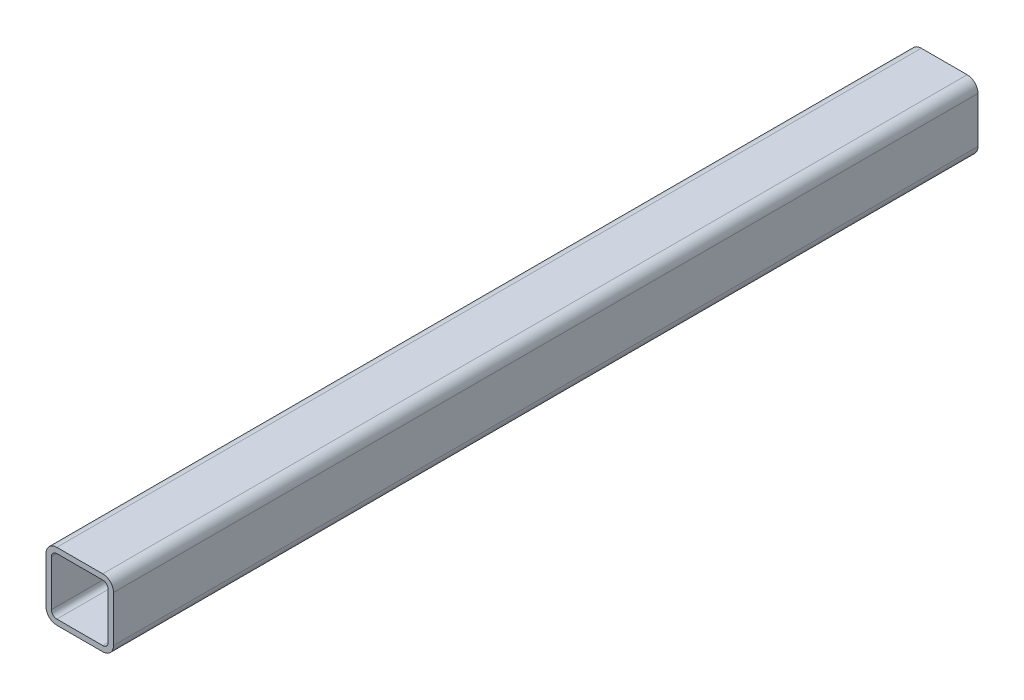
ISO-10303-21;
HEADER;
FILE_DESCRIPTION(('STEP AP214'),'2;1');
FILE_NAME('part.step','',(''),(''),'','','');
FILE_SCHEMA(('AUTOMOTIVE_DESIGN { 1 0 10303 214 1 1 1 1 }'));
ENDSEC;
DATA;
#1=APPLICATION_CONTEXT('core data for automotive mechanical design processes');
#2=APPLICATION_PROTOCOL_DEFINITION('international standard','automotive_design',2000,#1);
#3=PRODUCT_CONTEXT('',#1,'mechanical');
#4=PRODUCT('Part','Part','',(#3));
#5=PRODUCT_RELATED_PRODUCT_CATEGORY('part','',(#4));
#6=PRODUCT_DEFINITION_FORMATION('','',#4);
#7=PRODUCT_DEFINITION_CONTEXT('part definition',#1,'design');
#8=PRODUCT_DEFINITION('design','',#6,#7);
#9=PRODUCT_DEFINITION_SHAPE('','',#8);
#10=(LENGTH_UNIT() NAMED_UNIT(*) SI_UNIT(.MILLI.,.METRE.));
#11=(NAMED_UNIT(*) PLANE_ANGLE_UNIT() SI_UNIT($,.RADIAN.));
#12=(NAMED_UNIT(*) SI_UNIT($,.STERADIAN.) SOLID_ANGLE_UNIT());
#13=UNCERTAINTY_MEASURE_WITH_UNIT(LENGTH_MEASURE(1.E-05),#10,'distance_accuracy_value','');
#14=(GEOMETRIC_REPRESENTATION_CONTEXT(3) GLOBAL_UNCERTAINTY_ASSIGNED_CONTEXT((#13)) GLOBAL_UNIT_ASSIGNED_CONTEXT((#10,
#11,#12)) REPRESENTATION_CONTEXT('',''));
#15=CARTESIAN_POINT('',(0.,0.,0.));
#16=DIRECTION('',(0.,0.,1.));
#17=DIRECTION('',(1.,0.,0.));
#18=AXIS2_PLACEMENT_3D('',#15,#16,#17);
#19=CARTESIAN_POINT('',(12.5,12.5,160.));
#20=DIRECTION('',(0.,0.,1.));
#21=DIRECTION('',(1.,0.,0.));
#22=AXIS2_PLACEMENT_3D('',#19,#20,#21);
#23=PLANE('',#22);
#24=DIRECTION('',(1.,0.,0.));
#25=VECTOR('',#24,1.);
#26=CARTESIAN_POINT('',(-12.5,-12.5,160.));
#27=LINE('',#26,#25);
#28=CARTESIAN_POINT('',(-8.5,-12.5,160.));
#29=VERTEX_POINT('',#28);
#30=CARTESIAN_POINT('',(8.5,-12.5,160.));
#31=VERTEX_POINT('',#30);
#32=EDGE_CURVE('E197',#29,#31,#27,.T.);
#33=ORIENTED_EDGE('',*,*,#32,.T.);
#34=CARTESIAN_POINT('',(8.5,-8.5,160.));
#35=DIRECTION('',(0.,0.,1.));
#36=DIRECTION('',(1.,0.,0.));
#37=AXIS2_PLACEMENT_3D('',#34,#35,#36);
#38=CIRCLE('',#37,4.);
#39=CARTESIAN_POINT('',(12.5,-8.5,160.));
#40=VERTEX_POINT('',#39);
#41=EDGE_CURVE('E256',#31,#40,#38,.T.);
#42=ORIENTED_EDGE('',*,*,#41,.T.);
#43=DIRECTION('',(0.,1.,0.));
#44=VECTOR('',#43,1.);
#45=CARTESIAN_POINT('',(12.5,12.5,160.));
#46=LINE('',#45,#44);
#47=CARTESIAN_POINT('',(12.5,8.5,160.));
#48=VERTEX_POINT('',#47);
#49=EDGE_CURVE('E274',#40,#48,#46,.T.);
#50=ORIENTED_EDGE('',*,*,#49,.T.);
#51=CARTESIAN_POINT('',(8.5,8.5,160.));
#52=DIRECTION('',(0.,0.,1.));
#53=DIRECTION('',(1.,0.,0.));
#54=AXIS2_PLACEMENT_3D('',#51,#52,#53);
#55=CIRCLE('',#54,4.);
#56=CARTESIAN_POINT('',(8.5,12.5,160.));
#57=VERTEX_POINT('',#56);
#58=EDGE_CURVE('E252',#48,#57,#55,.T.);
#59=ORIENTED_EDGE('',*,*,#58,.T.);
#60=DIRECTION('',(-1.,0.,0.));
#61=VECTOR('',#60,1.);
#62=CARTESIAN_POINT('',(-12.5,12.5,160.));
#63=LINE('',#62,#61);
#64=CARTESIAN_POINT('',(-8.5,12.5,160.));
#65=VERTEX_POINT('',#64);
#66=EDGE_CURVE('E266',#57,#65,#63,.T.);
#67=ORIENTED_EDGE('',*,*,#66,.T.);
#68=CARTESIAN_POINT('',(-8.5,8.5,160.));
#69=DIRECTION('',(0.,0.,1.));
#70=DIRECTION('',(1.,0.,0.));
#71=AXIS2_PLACEMENT_3D('',#68,#69,#70);
#72=CIRCLE('',#71,4.);
#73=CARTESIAN_POINT('',(-12.5,8.5,160.));
#74=VERTEX_POINT('',#73);
#75=EDGE_CURVE('E79',#65,#74,#72,.T.);
#76=ORIENTED_EDGE('',*,*,#75,.T.);
#77=DIRECTION('',(0.,-1.,0.));
#78=VECTOR('',#77,1.);
#79=CARTESIAN_POINT('',(-12.5,12.5,160.));
#80=LINE('',#79,#78);
#81=CARTESIAN_POINT('',(-12.5,-8.5,160.));
#82=VERTEX_POINT('',#81);
#83=EDGE_CURVE('E202',#74,#82,#80,.T.);
#84=ORIENTED_EDGE('',*,*,#83,.T.);
#85=CARTESIAN_POINT('',(-8.5,-8.5,160.));
#86=DIRECTION('',(0.,0.,1.));
#87=DIRECTION('',(1.,0.,0.));
#88=AXIS2_PLACEMENT_3D('',#85,#86,#87);
#89=CIRCLE('',#88,4.);
#90=EDGE_CURVE('E254',#82,#29,#89,.T.);
#91=ORIENTED_EDGE('',*,*,#90,.T.);
#92=EDGE_LOOP('',(#33,#42,#50,#59,#67,#76,#84,#91));
#93=FACE_BOUND('',#92,.T.);
#94=DIRECTION('',(-1.,0.,0.));
#95=VECTOR('',#94,1.);
#96=CARTESIAN_POINT('',(-12.5,10.5,160.));
#97=LINE('',#96,#95);
#98=CARTESIAN_POINT('',(8.5,10.5,160.));
#99=VERTEX_POINT('',#98);
#100=CARTESIAN_POINT('',(-8.5,10.5,160.));
#101=VERTEX_POINT('',#100);
#102=EDGE_CURVE('E303',#99,#101,#97,.T.);
#103=ORIENTED_EDGE('',*,*,#102,.F.);
#104=CARTESIAN_POINT('',(8.5,8.5,160.));
#105=DIRECTION('',(0.,0.,1.));
#106=DIRECTION('',(1.,0.,0.));
#107=AXIS2_PLACEMENT_3D('',#104,#105,#106);
#108=CIRCLE('',#107,2.);
#109=CARTESIAN_POINT('',(10.5,8.5,160.));
#110=VERTEX_POINT('',#109);
#111=EDGE_CURVE('E183',#99,#110,#108,.F.);
#112=ORIENTED_EDGE('',*,*,#111,.T.);
#113=DIRECTION('',(0.,1.,0.));
#114=VECTOR('',#113,1.);
#115=CARTESIAN_POINT('',(10.5,12.5,160.));
#116=LINE('',#115,#114);
#117=CARTESIAN_POINT('',(10.5,-8.5,160.));
#118=VERTEX_POINT('',#117);
#119=EDGE_CURVE('E193',#118,#110,#116,.T.);
#120=ORIENTED_EDGE('',*,*,#119,.F.);
#121=CARTESIAN_POINT('',(8.5,-8.5,160.));
#122=DIRECTION('',(0.,0.,1.));
#123=DIRECTION('',(1.,0.,0.));
#124=AXIS2_PLACEMENT_3D('',#121,#122,#123);
#125=CIRCLE('',#124,2.);
#126=CARTESIAN_POINT('',(8.5,-10.5,160.));
#127=VERTEX_POINT('',#126);
#128=EDGE_CURVE('E223',#118,#127,#125,.F.);
#129=ORIENTED_EDGE('',*,*,#128,.T.);
#130=DIRECTION('',(1.,0.,0.));
#131=VECTOR('',#130,1.);
#132=CARTESIAN_POINT('',(-12.5,-10.5,160.));
#133=LINE('',#132,#131);
#134=CARTESIAN_POINT('',(-8.5,-10.5,160.));
#135=VERTEX_POINT('',#134);
#136=EDGE_CURVE('E288',#135,#127,#133,.T.);
#137=ORIENTED_EDGE('',*,*,#136,.F.);
#138=CARTESIAN_POINT('',(-8.5,-8.5,160.));
#139=DIRECTION('',(0.,0.,1.));
#140=DIRECTION('',(1.,0.,0.));
#141=AXIS2_PLACEMENT_3D('',#138,#139,#140);
#142=CIRCLE('',#141,2.);
#143=CARTESIAN_POINT('',(-10.5,-8.5,160.));
#144=VERTEX_POINT('',#143);
#145=EDGE_CURVE('E182',#135,#144,#142,.F.);
#146=ORIENTED_EDGE('',*,*,#145,.T.);
#147=DIRECTION('',(0.,-1.,0.));
#148=VECTOR('',#147,1.);
#149=CARTESIAN_POINT('',(-10.5,12.5,160.));
#150=LINE('',#149,#148);
#151=CARTESIAN_POINT('',(-10.5,8.5,160.));
#152=VERTEX_POINT('',#151);
#153=EDGE_CURVE('E300',#152,#144,#150,.T.);
#154=ORIENTED_EDGE('',*,*,#153,.F.);
#155=CARTESIAN_POINT('',(-8.5,8.5,160.));
#156=DIRECTION('',(0.,0.,1.));
#157=DIRECTION('',(1.,0.,0.));
#158=AXIS2_PLACEMENT_3D('',#155,#156,#157);
#159=CIRCLE('',#158,2.);
#160=EDGE_CURVE('E227',#152,#101,#159,.F.);
#161=ORIENTED_EDGE('',*,*,#160,.T.);
#162=EDGE_LOOP('',(#103,#112,#120,#129,#137,#146,#154,#161));
#163=FACE_BOUND('',#162,.T.);
#164=ADVANCED_FACE('F57',(#93,#163),#23,.T.);
#165=CARTESIAN_POINT('',(12.5,12.5,-160.));
#166=DIRECTION('',(0.,0.,1.));
#167=DIRECTION('',(1.,0.,0.));
#168=AXIS2_PLACEMENT_3D('',#165,#166,#167);
#169=PLANE('',#168);
#170=DIRECTION('',(0.,1.,0.));
#171=VECTOR('',#170,1.);
#172=CARTESIAN_POINT('',(12.5,12.5,-160.));
#173=LINE('',#172,#171);
#174=CARTESIAN_POINT('',(12.5,-8.5,-160.));
#175=VERTEX_POINT('',#174);
#176=CARTESIAN_POINT('',(12.5,8.5,-160.));
#177=VERTEX_POINT('',#176);
#178=EDGE_CURVE('E284',#175,#177,#173,.T.);
#179=ORIENTED_EDGE('',*,*,#178,.F.);
#180=CARTESIAN_POINT('',(8.5,-8.5,-160.));
#181=DIRECTION('',(0.,0.,1.));
#182=DIRECTION('',(1.,0.,0.));
#183=AXIS2_PLACEMENT_3D('',#180,#181,#182);
#184=CIRCLE('',#183,4.);
#185=CARTESIAN_POINT('',(8.5,-12.5,-160.));
#186=VERTEX_POINT('',#185);
#187=EDGE_CURVE('E244',#175,#186,#184,.F.);
#188=ORIENTED_EDGE('',*,*,#187,.T.);
#189=DIRECTION('',(1.,0.,0.));
#190=VECTOR('',#189,1.);
#191=CARTESIAN_POINT('',(-12.5,-12.5,-160.));
#192=LINE('',#191,#190);
#193=CARTESIAN_POINT('',(-8.5,-12.5,-160.));
#194=VERTEX_POINT('',#193);
#195=EDGE_CURVE('E205',#194,#186,#192,.T.);
#196=ORIENTED_EDGE('',*,*,#195,.F.);
#197=CARTESIAN_POINT('',(-8.5,-8.5,-160.));
#198=DIRECTION('',(0.,0.,1.));
#199=DIRECTION('',(1.,0.,0.));
#200=AXIS2_PLACEMENT_3D('',#197,#198,#199);
#201=CIRCLE('',#200,4.);
#202=CARTESIAN_POINT('',(-12.5,-8.5,-160.));
#203=VERTEX_POINT('',#202);
#204=EDGE_CURVE('E242',#194,#203,#201,.F.);
#205=ORIENTED_EDGE('',*,*,#204,.T.);
#206=DIRECTION('',(0.,-1.,0.));
#207=VECTOR('',#206,1.);
#208=CARTESIAN_POINT('',(-12.5,12.5,-160.));
#209=LINE('',#208,#207);
#210=CARTESIAN_POINT('',(-12.5,8.5,-160.));
#211=VERTEX_POINT('',#210);
#212=EDGE_CURVE('E279',#211,#203,#209,.T.);
#213=ORIENTED_EDGE('',*,*,#212,.F.);
#214=CARTESIAN_POINT('',(-8.5,8.5,-160.));
#215=DIRECTION('',(0.,0.,1.));
#216=DIRECTION('',(1.,0.,0.));
#217=AXIS2_PLACEMENT_3D('',#214,#215,#216);
#218=CIRCLE('',#217,4.);
#219=CARTESIAN_POINT('',(-8.5,12.5,-160.));
#220=VERTEX_POINT('',#219);
#221=EDGE_CURVE('E238',#211,#220,#218,.F.);
#222=ORIENTED_EDGE('',*,*,#221,.T.);
#223=DIRECTION('',(-1.,0.,0.));
#224=VECTOR('',#223,1.);
#225=CARTESIAN_POINT('',(-12.5,12.5,-160.));
#226=LINE('',#225,#224);
#227=CARTESIAN_POINT('',(8.5,12.5,-160.));
#228=VERTEX_POINT('',#227);
#229=EDGE_CURVE('E269',#228,#220,#226,.T.);
#230=ORIENTED_EDGE('',*,*,#229,.F.);
#231=CARTESIAN_POINT('',(8.5,8.5,-160.));
#232=DIRECTION('',(0.,0.,1.));
#233=DIRECTION('',(1.,0.,0.));
#234=AXIS2_PLACEMENT_3D('',#231,#232,#233);
#235=CIRCLE('',#234,4.);
#236=EDGE_CURVE('E240',#228,#177,#235,.F.);
#237=ORIENTED_EDGE('',*,*,#236,.T.);
#238=EDGE_LOOP('',(#179,#188,#196,#205,#213,#222,#230,#237));
#239=FACE_BOUND('',#238,.T.);
#240=DIRECTION('',(1.,0.,0.));
#241=VECTOR('',#240,1.);
#242=CARTESIAN_POINT('',(-12.5,-10.5,-160.));
#243=LINE('',#242,#241);
#244=CARTESIAN_POINT('',(-8.5,-10.5,-160.));
#245=VERTEX_POINT('',#244);
#246=CARTESIAN_POINT('',(8.5,-10.5,-160.));
#247=VERTEX_POINT('',#246);
#248=EDGE_CURVE('E175',#245,#247,#243,.T.);
#249=ORIENTED_EDGE('',*,*,#248,.T.);
#250=CARTESIAN_POINT('',(8.5,-8.5,-160.));
#251=DIRECTION('',(0.,0.,1.));
#252=DIRECTION('',(1.,0.,0.));
#253=AXIS2_PLACEMENT_3D('',#250,#251,#252);
#254=CIRCLE('',#253,2.);
#255=CARTESIAN_POINT('',(10.5,-8.5,-160.));
#256=VERTEX_POINT('',#255);
#257=EDGE_CURVE('E221',#247,#256,#254,.T.);
#258=ORIENTED_EDGE('',*,*,#257,.T.);
#259=DIRECTION('',(0.,1.,0.));
#260=VECTOR('',#259,1.);
#261=CARTESIAN_POINT('',(10.5,12.5,-160.));
#262=LINE('',#261,#260);
#263=CARTESIAN_POINT('',(10.5,8.5,-160.));
#264=VERTEX_POINT('',#263);
#265=EDGE_CURVE('E296',#256,#264,#262,.T.);
#266=ORIENTED_EDGE('',*,*,#265,.T.);
#267=CARTESIAN_POINT('',(8.5,8.5,-160.));
#268=DIRECTION('',(0.,0.,1.));
#269=DIRECTION('',(1.,0.,0.));
#270=AXIS2_PLACEMENT_3D('',#267,#268,#269);
#271=CIRCLE('',#270,2.);
#272=CARTESIAN_POINT('',(8.5,10.5,-160.));
#273=VERTEX_POINT('',#272);
#274=EDGE_CURVE('E229',#264,#273,#271,.T.);
#275=ORIENTED_EDGE('',*,*,#274,.T.);
#276=DIRECTION('',(-1.,0.,0.));
#277=VECTOR('',#276,1.);
#278=CARTESIAN_POINT('',(-12.5,10.5,-160.));
#279=LINE('',#278,#277);
#280=CARTESIAN_POINT('',(-8.5,10.5,-160.));
#281=VERTEX_POINT('',#280);
#282=EDGE_CURVE('E293',#273,#281,#279,.T.);
#283=ORIENTED_EDGE('',*,*,#282,.T.);
#284=CARTESIAN_POINT('',(-8.5,8.5,-160.));
#285=DIRECTION('',(0.,0.,1.));
#286=DIRECTION('',(1.,0.,0.));
#287=AXIS2_PLACEMENT_3D('',#284,#285,#286);
#288=CIRCLE('',#287,2.);
#289=CARTESIAN_POINT('',(-10.5,8.5,-160.));
#290=VERTEX_POINT('',#289);
#291=EDGE_CURVE('E225',#281,#290,#288,.T.);
#292=ORIENTED_EDGE('',*,*,#291,.T.);
#293=DIRECTION('',(0.,-1.,0.));
#294=VECTOR('',#293,1.);
#295=CARTESIAN_POINT('',(-10.5,12.5,-160.));
#296=LINE('',#295,#294);
#297=CARTESIAN_POINT('',(-10.5,-8.5,-160.));
#298=VERTEX_POINT('',#297);
#299=EDGE_CURVE('E177',#290,#298,#296,.T.);
#300=ORIENTED_EDGE('',*,*,#299,.T.);
#301=CARTESIAN_POINT('',(-8.5,-8.5,-160.));
#302=DIRECTION('',(0.,0.,1.));
#303=DIRECTION('',(1.,0.,0.));
#304=AXIS2_PLACEMENT_3D('',#301,#302,#303);
#305=CIRCLE('',#304,2.);
#306=EDGE_CURVE('E172',#298,#245,#305,.T.);
#307=ORIENTED_EDGE('',*,*,#306,.T.);
#308=EDGE_LOOP('',(#249,#258,#266,#275,#283,#292,#300,#307));
#309=FACE_BOUND('',#308,.T.);
#310=ADVANCED_FACE('F174',(#239,#309),#169,.F.);
#311=CARTESIAN_POINT('',(12.5,12.5,160.));
#312=DIRECTION('',(-1.,0.,0.));
#313=DIRECTION('',(0.,-1.,0.));
#314=AXIS2_PLACEMENT_3D('',#311,#312,#313);
#315=PLANE('',#314);
#316=ORIENTED_EDGE('',*,*,#49,.F.);
#317=DIRECTION('',(0.,0.,-1.));
#318=VECTOR('',#317,1.);
#319=CARTESIAN_POINT('',(12.5,-8.5,160.));
#320=LINE('',#319,#318);
#321=EDGE_CURVE('E235',#40,#175,#320,.T.);
#322=ORIENTED_EDGE('',*,*,#321,.T.);
#323=ORIENTED_EDGE('',*,*,#178,.T.);
#324=DIRECTION('',(0.,0.,-1.));
#325=VECTOR('',#324,1.);
#326=CARTESIAN_POINT('',(12.5,8.5,160.));
#327=LINE('',#326,#325);
#328=EDGE_CURVE('E233',#177,#48,#327,.F.);
#329=ORIENTED_EDGE('',*,*,#328,.T.);
#330=EDGE_LOOP('',(#316,#322,#323,#329));
#331=FACE_BOUND('',#330,.T.);
#332=ADVANCED_FACE('F348',(#331),#315,.F.);
#333=CARTESIAN_POINT('',(-12.5,12.5,160.));
#334=DIRECTION('',(0.,-1.,0.));
#335=DIRECTION('',(0.,0.,-1.));
#336=AXIS2_PLACEMENT_3D('',#333,#334,#335);
#337=PLANE('',#336);
#338=ORIENTED_EDGE('',*,*,#66,.F.);
#339=DIRECTION('',(0.,0.,-1.));
#340=VECTOR('',#339,1.);
#341=CARTESIAN_POINT('',(8.5,12.5,160.));
#342=LINE('',#341,#340);
#343=EDGE_CURVE('E12',#57,#228,#342,.T.);
#344=ORIENTED_EDGE('',*,*,#343,.T.);
#345=ORIENTED_EDGE('',*,*,#229,.T.);
#346=DIRECTION('',(0.,0.,-1.));
#347=VECTOR('',#346,1.);
#348=CARTESIAN_POINT('',(-8.5,12.5,160.));
#349=LINE('',#348,#347);
#350=EDGE_CURVE('E65',#220,#65,#349,.F.);
#351=ORIENTED_EDGE('',*,*,#350,.T.);
#352=EDGE_LOOP('',(#338,#344,#345,#351));
#353=FACE_BOUND('',#352,.T.);
#354=ADVANCED_FACE('F265',(#353),#337,.F.);
#355=CARTESIAN_POINT('',(-12.5,12.5,160.));
#356=DIRECTION('',(1.,0.,0.));
#357=DIRECTION('',(0.,1.,0.));
#358=AXIS2_PLACEMENT_3D('',#355,#356,#357);
#359=PLANE('',#358);
#360=ORIENTED_EDGE('',*,*,#212,.T.);
#361=DIRECTION('',(0.,0.,-1.));
#362=VECTOR('',#361,1.);
#363=CARTESIAN_POINT('',(-12.5,-8.5,160.));
#364=LINE('',#363,#362);
#365=EDGE_CURVE('E72',#203,#82,#364,.F.);
#366=ORIENTED_EDGE('',*,*,#365,.T.);
#367=ORIENTED_EDGE('',*,*,#83,.F.);
#368=DIRECTION('',(0.,0.,-1.));
#369=VECTOR('',#368,1.);
#370=CARTESIAN_POINT('',(-12.5,8.5,160.));
#371=LINE('',#370,#369);
#372=EDGE_CURVE('E258',#74,#211,#371,.T.);
#373=ORIENTED_EDGE('',*,*,#372,.T.);
#374=EDGE_LOOP('',(#360,#366,#367,#373));
#375=FACE_BOUND('',#374,.T.);
#376=ADVANCED_FACE('F278',(#375),#359,.F.);
#377=CARTESIAN_POINT('',(-12.5,-12.5,160.));
#378=DIRECTION('',(0.,1.,0.));
#379=DIRECTION('',(0.,0.,1.));
#380=AXIS2_PLACEMENT_3D('',#377,#378,#379);
#381=PLANE('',#380);
#382=ORIENTED_EDGE('',*,*,#195,.T.);
#383=DIRECTION('',(0.,0.,-1.));
#384=VECTOR('',#383,1.);
#385=CARTESIAN_POINT('',(8.5,-12.5,160.));
#386=LINE('',#385,#384);
#387=EDGE_CURVE('E249',#186,#31,#386,.F.);
#388=ORIENTED_EDGE('',*,*,#387,.T.);
#389=ORIENTED_EDGE('',*,*,#32,.F.);
#390=DIRECTION('',(0.,0.,-1.));
#391=VECTOR('',#390,1.);
#392=CARTESIAN_POINT('',(-8.5,-12.5,160.));
#393=LINE('',#392,#391);
#394=EDGE_CURVE('E246',#29,#194,#393,.T.);
#395=ORIENTED_EDGE('',*,*,#394,.T.);
#396=EDGE_LOOP('',(#382,#388,#389,#395));
#397=FACE_BOUND('',#396,.T.);
#398=ADVANCED_FACE('F353',(#397),#381,.F.);
#399=CARTESIAN_POINT('',(10.5,12.5,160.));
#400=DIRECTION('',(-1.,0.,0.));
#401=DIRECTION('',(0.,-1.,0.));
#402=AXIS2_PLACEMENT_3D('',#399,#400,#401);
#403=PLANE('',#402);
#404=ORIENTED_EDGE('',*,*,#265,.F.);
#405=DIRECTION('',(0.,0.,-1.));
#406=VECTOR('',#405,1.);
#407=CARTESIAN_POINT('',(10.5,-8.5,160.));
#408=LINE('',#407,#406);
#409=EDGE_CURVE('E210',#256,#118,#408,.F.);
#410=ORIENTED_EDGE('',*,*,#409,.T.);
#411=ORIENTED_EDGE('',*,*,#119,.T.);
#412=DIRECTION('',(0.,0.,-1.));
#413=VECTOR('',#412,1.);
#414=CARTESIAN_POINT('',(10.5,8.5,-160.));
#415=LINE('',#414,#413);
#416=EDGE_CURVE('E199',#110,#264,#415,.T.);
#417=ORIENTED_EDGE('',*,*,#416,.T.);
#418=EDGE_LOOP('',(#404,#410,#411,#417));
#419=FACE_BOUND('',#418,.T.);
#420=ADVANCED_FACE('F311',(#419),#403,.T.);
#421=CARTESIAN_POINT('',(-12.5,10.5,160.));
#422=DIRECTION('',(0.,-1.,0.));
#423=DIRECTION('',(0.,0.,-1.));
#424=AXIS2_PLACEMENT_3D('',#421,#422,#423);
#425=PLANE('',#424);
#426=ORIENTED_EDGE('',*,*,#102,.T.);
#427=DIRECTION('',(0.,0.,-1.));
#428=VECTOR('',#427,1.);
#429=CARTESIAN_POINT('',(-8.5,10.5,-160.));
#430=LINE('',#429,#428);
#431=EDGE_CURVE('E214',#101,#281,#430,.T.);
#432=ORIENTED_EDGE('',*,*,#431,.T.);
#433=ORIENTED_EDGE('',*,*,#282,.F.);
#434=DIRECTION('',(0.,0.,-1.));
#435=VECTOR('',#434,1.);
#436=CARTESIAN_POINT('',(8.5,10.5,160.));
#437=LINE('',#436,#435);
#438=EDGE_CURVE('E212',#273,#99,#437,.F.);
#439=ORIENTED_EDGE('',*,*,#438,.T.);
#440=EDGE_LOOP('',(#426,#432,#433,#439));
#441=FACE_BOUND('',#440,.T.);
#442=ADVANCED_FACE('F320',(#441),#425,.T.);
#443=CARTESIAN_POINT('',(-10.5,12.5,160.));
#444=DIRECTION('',(1.,0.,0.));
#445=DIRECTION('',(0.,1.,0.));
#446=AXIS2_PLACEMENT_3D('',#443,#444,#445);
#447=PLANE('',#446);
#448=ORIENTED_EDGE('',*,*,#299,.F.);
#449=DIRECTION('',(0.,0.,-1.));
#450=VECTOR('',#449,1.);
#451=CARTESIAN_POINT('',(-10.5,8.5,160.));
#452=LINE('',#451,#450);
#453=EDGE_CURVE('E219',#290,#152,#452,.F.);
#454=ORIENTED_EDGE('',*,*,#453,.T.);
#455=ORIENTED_EDGE('',*,*,#153,.T.);
#456=DIRECTION('',(0.,0.,-1.));
#457=VECTOR('',#456,1.);
#458=CARTESIAN_POINT('',(-10.5,-8.5,-160.));
#459=LINE('',#458,#457);
#460=EDGE_CURVE('E217',#144,#298,#459,.T.);
#461=ORIENTED_EDGE('',*,*,#460,.T.);
#462=EDGE_LOOP('',(#448,#454,#455,#461));
#463=FACE_BOUND('',#462,.T.);
#464=ADVANCED_FACE('F328',(#463),#447,.T.);
#465=CARTESIAN_POINT('',(-12.5,-10.5,160.));
#466=DIRECTION('',(0.,1.,0.));
#467=DIRECTION('',(0.,0.,1.));
#468=AXIS2_PLACEMENT_3D('',#465,#466,#467);
#469=PLANE('',#468);
#470=ORIENTED_EDGE('',*,*,#136,.T.);
#471=DIRECTION('',(0.,0.,-1.));
#472=VECTOR('',#471,1.);
#473=CARTESIAN_POINT('',(8.5,-10.5,-160.));
#474=LINE('',#473,#472);
#475=EDGE_CURVE('E192',#127,#247,#474,.T.);
#476=ORIENTED_EDGE('',*,*,#475,.T.);
#477=ORIENTED_EDGE('',*,*,#248,.F.);
#478=DIRECTION('',(0.,0.,-1.));
#479=VECTOR('',#478,1.);
#480=CARTESIAN_POINT('',(-8.5,-10.5,160.));
#481=LINE('',#480,#479);
#482=EDGE_CURVE('E189',#245,#135,#481,.F.);
#483=ORIENTED_EDGE('',*,*,#482,.T.);
#484=EDGE_LOOP('',(#470,#476,#477,#483));
#485=FACE_BOUND('',#484,.T.);
#486=ADVANCED_FACE('F188',(#485),#469,.T.);
#487=CARTESIAN_POINT('',(8.5,-8.5,160.));
#488=DIRECTION('',(0.,0.,1.));
#489=DIRECTION('',(1.,0.,0.));
#490=AXIS2_PLACEMENT_3D('',#487,#488,#489);
#491=CYLINDRICAL_SURFACE('',#490,2.);
#492=ORIENTED_EDGE('',*,*,#128,.F.);
#493=ORIENTED_EDGE('',*,*,#409,.F.);
#494=ORIENTED_EDGE('',*,*,#257,.F.);
#495=ORIENTED_EDGE('',*,*,#475,.F.);
#496=EDGE_LOOP('',(#492,#493,#494,#495));
#497=FACE_BOUND('',#496,.T.);
#498=ADVANCED_FACE('F331',(#497),#491,.F.);
#499=CARTESIAN_POINT('',(-8.5,8.5,160.));
#500=DIRECTION('',(0.,0.,1.));
#501=DIRECTION('',(1.,0.,0.));
#502=AXIS2_PLACEMENT_3D('',#499,#500,#501);
#503=CYLINDRICAL_SURFACE('',#502,2.);
#504=ORIENTED_EDGE('',*,*,#160,.F.);
#505=ORIENTED_EDGE('',*,*,#453,.F.);
#506=ORIENTED_EDGE('',*,*,#291,.F.);
#507=ORIENTED_EDGE('',*,*,#431,.F.);
#508=EDGE_LOOP('',(#504,#505,#506,#507));
#509=FACE_BOUND('',#508,.T.);
#510=ADVANCED_FACE('F325',(#509),#503,.F.);
#511=CARTESIAN_POINT('',(8.5,8.5,160.));
#512=DIRECTION('',(0.,0.,1.));
#513=DIRECTION('',(1.,0.,0.));
#514=AXIS2_PLACEMENT_3D('',#511,#512,#513);
#515=CYLINDRICAL_SURFACE('',#514,2.);
#516=ORIENTED_EDGE('',*,*,#111,.F.);
#517=ORIENTED_EDGE('',*,*,#438,.F.);
#518=ORIENTED_EDGE('',*,*,#274,.F.);
#519=ORIENTED_EDGE('',*,*,#416,.F.);
#520=EDGE_LOOP('',(#516,#517,#518,#519));
#521=FACE_BOUND('',#520,.T.);
#522=ADVANCED_FACE('F316',(#521),#515,.F.);
#523=CARTESIAN_POINT('',(-8.5,-8.5,160.));
#524=DIRECTION('',(0.,0.,1.));
#525=DIRECTION('',(1.,0.,0.));
#526=AXIS2_PLACEMENT_3D('',#523,#524,#525);
#527=CYLINDRICAL_SURFACE('',#526,2.);
#528=ORIENTED_EDGE('',*,*,#145,.F.);
#529=ORIENTED_EDGE('',*,*,#482,.F.);
#530=ORIENTED_EDGE('',*,*,#306,.F.);
#531=ORIENTED_EDGE('',*,*,#460,.F.);
#532=EDGE_LOOP('',(#528,#529,#530,#531));
#533=FACE_BOUND('',#532,.T.);
#534=ADVANCED_FACE('F196',(#533),#527,.F.);
#535=CARTESIAN_POINT('',(8.5,-8.5,160.));
#536=DIRECTION('',(0.,0.,-1.));
#537=DIRECTION('',(-1.,0.,0.));
#538=AXIS2_PLACEMENT_3D('',#535,#536,#537);
#539=CYLINDRICAL_SURFACE('',#538,4.);
#540=ORIENTED_EDGE('',*,*,#41,.F.);
#541=ORIENTED_EDGE('',*,*,#387,.F.);
#542=ORIENTED_EDGE('',*,*,#187,.F.);
#543=ORIENTED_EDGE('',*,*,#321,.F.);
#544=EDGE_LOOP('',(#540,#541,#542,#543));
#545=FACE_BOUND('',#544,.T.);
#546=ADVANCED_FACE('F369',(#545),#539,.T.);
#547=CARTESIAN_POINT('',(-8.5,-8.5,160.));
#548=DIRECTION('',(0.,0.,-1.));
#549=DIRECTION('',(-1.,0.,0.));
#550=AXIS2_PLACEMENT_3D('',#547,#548,#549);
#551=CYLINDRICAL_SURFACE('',#550,4.);
#552=ORIENTED_EDGE('',*,*,#90,.F.);
#553=ORIENTED_EDGE('',*,*,#365,.F.);
#554=ORIENTED_EDGE('',*,*,#204,.F.);
#555=ORIENTED_EDGE('',*,*,#394,.F.);
#556=EDGE_LOOP('',(#552,#553,#554,#555));
#557=FACE_BOUND('',#556,.T.);
#558=ADVANCED_FACE('F375',(#557),#551,.T.);
#559=CARTESIAN_POINT('',(8.5,8.5,160.));
#560=DIRECTION('',(0.,0.,-1.));
#561=DIRECTION('',(-1.,0.,0.));
#562=AXIS2_PLACEMENT_3D('',#559,#560,#561);
#563=CYLINDRICAL_SURFACE('',#562,4.);
#564=ORIENTED_EDGE('',*,*,#58,.F.);
#565=ORIENTED_EDGE('',*,*,#328,.F.);
#566=ORIENTED_EDGE('',*,*,#236,.F.);
#567=ORIENTED_EDGE('',*,*,#343,.F.);
#568=EDGE_LOOP('',(#564,#565,#566,#567));
#569=FACE_BOUND('',#568,.T.);
#570=ADVANCED_FACE('F377',(#569),#563,.T.);
#571=CARTESIAN_POINT('',(-8.5,8.5,160.));
#572=DIRECTION('',(0.,0.,-1.));
#573=DIRECTION('',(-1.,0.,0.));
#574=AXIS2_PLACEMENT_3D('',#571,#572,#573);
#575=CYLINDRICAL_SURFACE('',#574,4.);
#576=ORIENTED_EDGE('',*,*,#75,.F.);
#577=ORIENTED_EDGE('',*,*,#350,.F.);
#578=ORIENTED_EDGE('',*,*,#221,.F.);
#579=ORIENTED_EDGE('',*,*,#372,.F.);
#580=EDGE_LOOP('',(#576,#577,#578,#579));
#581=FACE_BOUND('',#580,.T.);
#582=ADVANCED_FACE('F59',(#581),#575,.T.);
#583=CLOSED_SHELL('',(#164,#310,#332,#354,#376,#398,#420,#442,#464,#486,#498,#510,#522,#534,
#546,#558,#570,#582));
#584=MANIFOLD_SOLID_BREP('B2',#583);
#585=ADVANCED_BREP_SHAPE_REPRESENTATION('',(#18,#584),#14);
#586=SHAPE_DEFINITION_REPRESENTATION(#9,#585);
ENDSEC;
END-ISO-10303-21;
